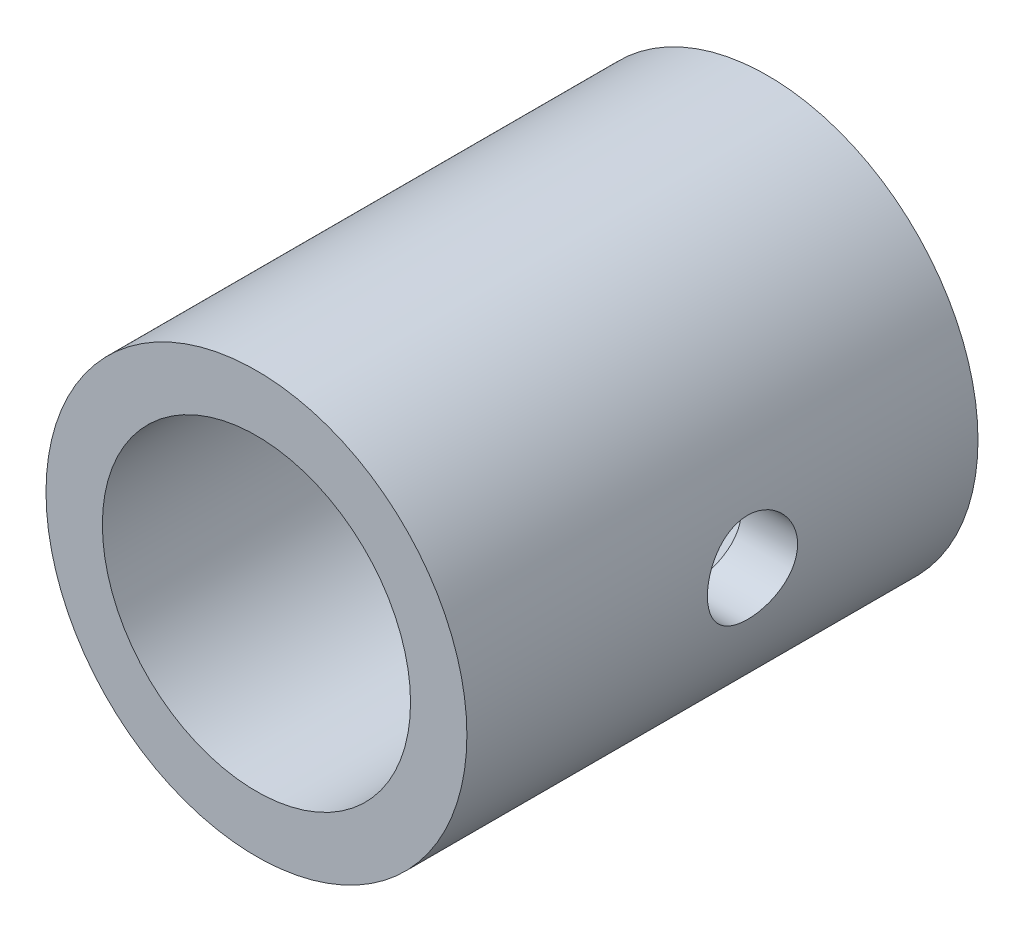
ISO-10303-21;
HEADER;
FILE_DESCRIPTION(('STEP AP214'),'2;1');
FILE_NAME('part.step','',(''),(''),'','','');
FILE_SCHEMA(('AUTOMOTIVE_DESIGN { 1 0 10303 214 1 1 1 1 }'));
ENDSEC;
DATA;
#1=APPLICATION_CONTEXT('core data for automotive mechanical design processes');
#2=APPLICATION_PROTOCOL_DEFINITION('international standard','automotive_design',2000,#1);
#3=PRODUCT_CONTEXT('',#1,'mechanical');
#4=PRODUCT('Part','Part','',(#3));
#5=PRODUCT_RELATED_PRODUCT_CATEGORY('part','',(#4));
#6=PRODUCT_DEFINITION_FORMATION('','',#4);
#7=PRODUCT_DEFINITION_CONTEXT('part definition',#1,'design');
#8=PRODUCT_DEFINITION('design','',#6,#7);
#9=PRODUCT_DEFINITION_SHAPE('','',#8);
#10=(LENGTH_UNIT() NAMED_UNIT(*) SI_UNIT(.MILLI.,.METRE.));
#11=(NAMED_UNIT(*) PLANE_ANGLE_UNIT() SI_UNIT($,.RADIAN.));
#12=(NAMED_UNIT(*) SI_UNIT($,.STERADIAN.) SOLID_ANGLE_UNIT());
#13=UNCERTAINTY_MEASURE_WITH_UNIT(LENGTH_MEASURE(1.E-05),#10,'distance_accuracy_value','');
#14=(GEOMETRIC_REPRESENTATION_CONTEXT(3) GLOBAL_UNCERTAINTY_ASSIGNED_CONTEXT((#13)) GLOBAL_UNIT_ASSIGNED_CONTEXT((#10,
#11,#12)) REPRESENTATION_CONTEXT('',''));
#15=CARTESIAN_POINT('',(0.,0.,0.));
#16=DIRECTION('',(0.,0.,1.));
#17=DIRECTION('',(1.,0.,0.));
#18=AXIS2_PLACEMENT_3D('',#15,#16,#17);
#19=CARTESIAN_POINT('',(0.,0.,34.));
#20=DIRECTION('',(0.,0.,1.));
#21=DIRECTION('',(1.,0.,0.));
#22=AXIS2_PLACEMENT_3D('',#19,#20,#21);
#23=PLANE('',#22);
#24=CARTESIAN_POINT('',(0.,0.,34.));
#25=DIRECTION('',(0.,0.,1.));
#26=DIRECTION('',(1.,0.,0.));
#27=AXIS2_PLACEMENT_3D('',#24,#25,#26);
#28=CIRCLE('',#27,14.);
#29=CARTESIAN_POINT('',(14.,0.,34.));
#30=VERTEX_POINT('',#29);
#31=EDGE_CURVE('E10',#30,#30,#28,.T.);
#32=ORIENTED_EDGE('',*,*,#31,.T.);
#33=EDGE_LOOP('',(#32));
#34=FACE_BOUND('',#33,.T.);
#35=CARTESIAN_POINT('',(0.,0.,34.));
#36=DIRECTION('',(0.,0.,1.));
#37=DIRECTION('',(1.,0.,0.));
#38=AXIS2_PLACEMENT_3D('',#35,#36,#37);
#39=CIRCLE('',#38,10.25);
#40=CARTESIAN_POINT('',(10.25,0.,34.));
#41=VERTEX_POINT('',#40);
#42=EDGE_CURVE('E49',#41,#41,#39,.T.);
#43=ORIENTED_EDGE('',*,*,#42,.F.);
#44=EDGE_LOOP('',(#43));
#45=FACE_BOUND('',#44,.T.);
#46=ADVANCED_FACE('F31',(#34,#45),#23,.T.);
#47=CARTESIAN_POINT('',(0.,0.,0.));
#48=DIRECTION('',(0.,0.,1.));
#49=DIRECTION('',(1.,0.,0.));
#50=AXIS2_PLACEMENT_3D('',#47,#48,#49);
#51=PLANE('',#50);
#52=CARTESIAN_POINT('',(0.,0.,0.));
#53=DIRECTION('',(0.,0.,1.));
#54=DIRECTION('',(1.,0.,0.));
#55=AXIS2_PLACEMENT_3D('',#52,#53,#54);
#56=CIRCLE('',#55,14.);
#57=CARTESIAN_POINT('',(14.,0.,0.));
#58=VERTEX_POINT('',#57);
#59=EDGE_CURVE('E44',#58,#58,#56,.T.);
#60=ORIENTED_EDGE('',*,*,#59,.F.);
#61=EDGE_LOOP('',(#60));
#62=FACE_BOUND('',#61,.T.);
#63=CARTESIAN_POINT('',(0.,0.,0.));
#64=DIRECTION('',(0.,0.,1.));
#65=DIRECTION('',(1.,0.,0.));
#66=AXIS2_PLACEMENT_3D('',#63,#64,#65);
#67=CIRCLE('',#66,10.25);
#68=CARTESIAN_POINT('',(10.25,0.,0.));
#69=VERTEX_POINT('',#68);
#70=EDGE_CURVE('E78',#69,#69,#67,.T.);
#71=ORIENTED_EDGE('',*,*,#70,.T.);
#72=EDGE_LOOP('',(#71));
#73=FACE_BOUND('',#72,.T.);
#74=ADVANCED_FACE('F86',(#62,#73),#51,.F.);
#75=CARTESIAN_POINT('',(0.,0.,34.));
#76=DIRECTION('',(0.,0.,-1.));
#77=DIRECTION('',(-1.,0.,0.));
#78=AXIS2_PLACEMENT_3D('',#75,#76,#77);
#79=CYLINDRICAL_SURFACE('',#78,14.);
#80=CARTESIAN_POINT('',(-14.,0.,12.));
#81=CARTESIAN_POINT('',(-13.9999969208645,0.166471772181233,12.0000057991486));
#82=CARTESIAN_POINT('',(-13.9970005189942,0.333014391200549,12.0139032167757));
#83=CARTESIAN_POINT('',(-13.9853365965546,0.661374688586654,12.0690713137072));
#84=CARTESIAN_POINT('',(-13.976664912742,0.82318880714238,12.1103620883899));
#85=CARTESIAN_POINT('',(-13.9546166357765,1.13729864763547,12.2189687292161));
#86=CARTESIAN_POINT('',(-13.9412448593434,1.28960392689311,12.2862579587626));
#87=CARTESIAN_POINT('',(-13.9112421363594,1.58075635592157,12.4448681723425));
#88=CARTESIAN_POINT('',(-13.8946113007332,1.71960396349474,12.5361883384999));
#89=CARTESIAN_POINT('',(-13.8596273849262,1.98204958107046,12.741760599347));
#90=CARTESIAN_POINT('',(-13.8412536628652,2.1054100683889,12.8563124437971));
#91=CARTESIAN_POINT('',(-13.8050013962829,2.3313208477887,13.1044526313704));
#92=CARTESIAN_POINT('',(-13.7871228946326,2.43386934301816,13.2380426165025));
#93=CARTESIAN_POINT('',(-13.7536823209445,2.61628408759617,13.5222115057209));
#94=CARTESIAN_POINT('',(-13.7381467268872,2.69589916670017,13.6729550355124));
#95=CARTESIAN_POINT('',(-13.7114465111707,2.82857647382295,13.9860689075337));
#96=CARTESIAN_POINT('',(-13.7002813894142,2.88164174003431,14.1484379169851));
#97=CARTESIAN_POINT('',(-13.6837961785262,2.95893148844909,14.4776221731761));
#98=CARTESIAN_POINT('',(-13.6783911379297,2.98357559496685,14.6443345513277));
#99=CARTESIAN_POINT('',(-13.6737827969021,3.00462790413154,14.979608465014));
#100=CARTESIAN_POINT('',(-13.6745787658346,3.00103943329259,15.1481697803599));
#101=CARTESIAN_POINT('',(-13.6822055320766,2.96606652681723,15.4792493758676));
#102=CARTESIAN_POINT('',(-13.6889308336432,2.93516797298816,15.6418217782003));
#103=CARTESIAN_POINT('',(-13.7074918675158,2.84722108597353,15.9594204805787));
#104=CARTESIAN_POINT('',(-13.719327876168,2.79017133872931,16.1144463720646));
#105=CARTESIAN_POINT('',(-13.7468816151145,2.65109102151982,16.4139257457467));
#106=CARTESIAN_POINT('',(-13.7626284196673,2.56887221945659,16.5582890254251));
#107=CARTESIAN_POINT('',(-13.7962114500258,2.38192014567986,16.8313503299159));
#108=CARTESIAN_POINT('',(-13.8140479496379,2.27718392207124,16.9600462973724));
#109=CARTESIAN_POINT('',(-13.8502543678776,2.0455908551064,17.2009187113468));
#110=CARTESIAN_POINT('',(-13.8686276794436,1.91832046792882,17.3126974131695));
#111=CARTESIAN_POINT('',(-13.9035003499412,1.64663461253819,17.5133874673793));
#112=CARTESIAN_POINT('',(-13.9199996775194,1.5022188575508,17.6022984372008));
#113=CARTESIAN_POINT('',(-13.9493155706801,1.19986692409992,17.7548213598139));
#114=CARTESIAN_POINT('',(-13.9621247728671,1.04190451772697,17.818382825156));
#115=CARTESIAN_POINT('',(-13.9825621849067,0.717206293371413,17.9179512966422));
#116=CARTESIAN_POINT('',(-13.9901911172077,0.550471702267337,17.9539621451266));
#117=CARTESIAN_POINT('',(-13.9993061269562,0.216375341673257,17.9968324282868));
#118=CARTESIAN_POINT('',(-14.0009067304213,0.0490863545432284,18.0042354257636));
#119=CARTESIAN_POINT('',(-13.9981049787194,-0.28433794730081,17.9911508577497));
#120=CARTESIAN_POINT('',(-13.993703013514,-0.450473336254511,17.9706651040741));
#121=CARTESIAN_POINT('',(-13.9794628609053,-0.775085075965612,17.9028355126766));
#122=CARTESIAN_POINT('',(-13.9696821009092,-0.933623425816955,17.8557752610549));
#123=CARTESIAN_POINT('',(-13.9457784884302,-1.24055690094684,17.7364461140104));
#124=CARTESIAN_POINT('',(-13.9316552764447,-1.38895118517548,17.6641751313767));
#125=CARTESIAN_POINT('',(-13.900350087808,-1.67364279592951,17.4953329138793));
#126=CARTESIAN_POINT('',(-13.8831286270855,-1.80974515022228,17.3984404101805));
#127=CARTESIAN_POINT('',(-13.8476206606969,-2.06395385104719,17.1835303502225));
#128=CARTESIAN_POINT('',(-13.8293340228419,-2.18205795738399,17.0655101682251));
#129=CARTESIAN_POINT('',(-13.7933634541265,-2.39905422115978,16.8092052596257));
#130=CARTESIAN_POINT('',(-13.7756958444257,-2.49757074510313,16.6705998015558));
#131=CARTESIAN_POINT('',(-13.7433330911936,-2.66992830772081,16.378490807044));
#132=CARTESIAN_POINT('',(-13.7286378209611,-2.74377039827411,16.224987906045));
#133=CARTESIAN_POINT('',(-13.7040201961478,-2.86419482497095,15.9082554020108));
#134=CARTESIAN_POINT('',(-13.6940714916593,-2.9109279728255,15.7450852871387));
#135=CARTESIAN_POINT('',(-13.6800237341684,-2.9762539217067,15.4129688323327));
#136=CARTESIAN_POINT('',(-13.6759237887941,-2.99485101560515,15.2440233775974));
#137=CARTESIAN_POINT('',(-13.6740923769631,-3.00319999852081,14.9089353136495));
#138=CARTESIAN_POINT('',(-13.6762295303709,-2.99354694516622,14.7428079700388));
#139=CARTESIAN_POINT('',(-13.6863352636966,-2.94699578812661,14.4146055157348));
#140=CARTESIAN_POINT('',(-13.6943037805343,-2.91009797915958,14.2525303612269));
#141=CARTESIAN_POINT('',(-13.7151116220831,-2.81038691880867,13.9374826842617));
#142=CARTESIAN_POINT('',(-13.7279352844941,-2.74765694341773,13.7844827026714));
#143=CARTESIAN_POINT('',(-13.757015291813,-2.59813503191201,13.4910892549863));
#144=CARTESIAN_POINT('',(-13.7732719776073,-2.51134070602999,13.3506970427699));
#145=CARTESIAN_POINT('',(-13.8077811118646,-2.31416580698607,13.0835636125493));
#146=CARTESIAN_POINT('',(-13.8260661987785,-2.20335974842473,12.957140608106));
#147=CARTESIAN_POINT('',(-13.8623489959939,-1.96217310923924,12.7244874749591));
#148=CARTESIAN_POINT('',(-13.8803466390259,-1.83178801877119,12.6182620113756));
#149=CARTESIAN_POINT('',(-13.9142898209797,-1.55320629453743,12.4277680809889));
#150=CARTESIAN_POINT('',(-13.9302072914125,-1.40480969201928,12.343786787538));
#151=CARTESIAN_POINT('',(-13.9579165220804,-1.09570032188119,12.2020909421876));
#152=CARTESIAN_POINT('',(-13.9697118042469,-0.934998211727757,12.1443539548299));
#153=CARTESIAN_POINT('',(-13.9856969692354,-0.645070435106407,12.0672956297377));
#154=CARTESIAN_POINT('',(-13.9910278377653,-0.517434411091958,12.0421071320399));
#155=CARTESIAN_POINT('',(-13.9981804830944,-0.259879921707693,12.0084573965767));
#156=CARTESIAN_POINT('',(-14.0000024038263,-0.12996155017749,11.9999954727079));
#157=CARTESIAN_POINT('',(-14.,0.,12.));
#158=B_SPLINE_CURVE_WITH_KNOTS('',3,(#80,#81,#82,#83,#84,#85,#86,#87,#88,#89,#90,#91,#92,#93,
#94,#95,#96,#97,#98,#99,#100,#101,#102,#103,#104,#105,#106,#107,#108,#109,#110,#111,#112,#113,
#114,#115,#116,#117,#118,#119,#120,#121,#122,#123,#124,#125,#126,#127,#128,#129,#130,#131,#132,
#133,#134,#135,#136,#137,#138,#139,#140,#141,#142,#143,#144,#145,#146,#147,#148,#149,#150,#151,
#152,#153,#154,#155,#156,#157),.UNSPECIFIED.,.T.,.F.,(4,2,2,2,2,2,2,2,2,2,2,2,2,2,2,2,2,2,2,2,2,
2,2,2,2,2,2,2,2,2,2,2,2,2,2,2,2,2,4),(0.,0.498939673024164,0.998245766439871,1.4970416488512,
1.99582055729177,2.50149923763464,3.00722155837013,3.5182885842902,4.02929711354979,
4.53266016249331,5.0359639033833,5.53048950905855,6.02504185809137,6.52338712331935,
7.02179775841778,7.53054022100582,8.039291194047,8.54905042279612,9.05873854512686,
9.55869331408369,10.0586156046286,10.5533012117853,11.0480277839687,11.5495746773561,
12.0511839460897,12.5616412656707,13.0720768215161,13.5796448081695,14.0871353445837,
14.5840136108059,15.0808865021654,15.5761699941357,16.0715026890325,16.5764590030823,
17.0815318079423,17.5928382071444,18.1037066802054,18.4932359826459,18.8827493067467),.UNSPECIFIED.);
#159=CARTESIAN_POINT('',(-14.,0.,12.));
#160=VERTEX_POINT('',#159);
#161=EDGE_CURVE('E73',#160,#160,#158,.T.);
#162=ORIENTED_EDGE('',*,*,#161,.T.);
#163=EDGE_LOOP('',(#162));
#164=FACE_BOUND('',#163,.T.);
#165=CARTESIAN_POINT('',(14.,0.,12.));
#166=CARTESIAN_POINT('',(13.9999969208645,-0.166471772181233,12.0000057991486));
#167=CARTESIAN_POINT('',(13.9970005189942,-0.333014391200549,12.0139032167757));
#168=CARTESIAN_POINT('',(13.9853365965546,-0.661374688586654,12.0690713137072));
#169=CARTESIAN_POINT('',(13.976664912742,-0.82318880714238,12.1103620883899));
#170=CARTESIAN_POINT('',(13.9546166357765,-1.13729864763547,12.2189687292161));
#171=CARTESIAN_POINT('',(13.9412448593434,-1.28960392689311,12.2862579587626));
#172=CARTESIAN_POINT('',(13.9112421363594,-1.58075635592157,12.4448681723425));
#173=CARTESIAN_POINT('',(13.8946113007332,-1.71960396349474,12.5361883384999));
#174=CARTESIAN_POINT('',(13.8596273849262,-1.98204958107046,12.741760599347));
#175=CARTESIAN_POINT('',(13.8412536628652,-2.1054100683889,12.8563124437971));
#176=CARTESIAN_POINT('',(13.8050013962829,-2.3313208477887,13.1044526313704));
#177=CARTESIAN_POINT('',(13.7871228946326,-2.43386934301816,13.2380426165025));
#178=CARTESIAN_POINT('',(13.7536823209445,-2.61628408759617,13.5222115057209));
#179=CARTESIAN_POINT('',(13.7381467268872,-2.69589916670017,13.6729550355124));
#180=CARTESIAN_POINT('',(13.7114465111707,-2.82857647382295,13.9860689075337));
#181=CARTESIAN_POINT('',(13.7002813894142,-2.88164174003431,14.1484379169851));
#182=CARTESIAN_POINT('',(13.6837961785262,-2.95893148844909,14.4776221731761));
#183=CARTESIAN_POINT('',(13.6783911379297,-2.98357559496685,14.6443345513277));
#184=CARTESIAN_POINT('',(13.6737827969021,-3.00462790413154,14.979608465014));
#185=CARTESIAN_POINT('',(13.6745787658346,-3.00103943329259,15.1481697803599));
#186=CARTESIAN_POINT('',(13.6822055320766,-2.96606652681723,15.4792493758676));
#187=CARTESIAN_POINT('',(13.6889308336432,-2.93516797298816,15.6418217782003));
#188=CARTESIAN_POINT('',(13.7074918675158,-2.84722108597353,15.9594204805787));
#189=CARTESIAN_POINT('',(13.719327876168,-2.79017133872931,16.1144463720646));
#190=CARTESIAN_POINT('',(13.7468816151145,-2.65109102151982,16.4139257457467));
#191=CARTESIAN_POINT('',(13.7626284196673,-2.56887221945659,16.5582890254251));
#192=CARTESIAN_POINT('',(13.7962114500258,-2.38192014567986,16.8313503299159));
#193=CARTESIAN_POINT('',(13.8140479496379,-2.27718392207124,16.9600462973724));
#194=CARTESIAN_POINT('',(13.8502543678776,-2.0455908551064,17.2009187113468));
#195=CARTESIAN_POINT('',(13.8686276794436,-1.91832046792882,17.3126974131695));
#196=CARTESIAN_POINT('',(13.9035003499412,-1.64663461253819,17.5133874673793));
#197=CARTESIAN_POINT('',(13.9199996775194,-1.5022188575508,17.6022984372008));
#198=CARTESIAN_POINT('',(13.9493155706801,-1.19986692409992,17.7548213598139));
#199=CARTESIAN_POINT('',(13.9621247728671,-1.04190451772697,17.818382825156));
#200=CARTESIAN_POINT('',(13.9825621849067,-0.717206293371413,17.9179512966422));
#201=CARTESIAN_POINT('',(13.9901911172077,-0.550471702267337,17.9539621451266));
#202=CARTESIAN_POINT('',(13.9993061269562,-0.216375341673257,17.9968324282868));
#203=CARTESIAN_POINT('',(14.0009067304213,-0.0490863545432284,18.0042354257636));
#204=CARTESIAN_POINT('',(13.9981049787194,0.28433794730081,17.9911508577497));
#205=CARTESIAN_POINT('',(13.993703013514,0.450473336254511,17.9706651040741));
#206=CARTESIAN_POINT('',(13.9794628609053,0.775085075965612,17.9028355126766));
#207=CARTESIAN_POINT('',(13.9696821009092,0.933623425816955,17.8557752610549));
#208=CARTESIAN_POINT('',(13.9457784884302,1.24055690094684,17.7364461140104));
#209=CARTESIAN_POINT('',(13.9316552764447,1.38895118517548,17.6641751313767));
#210=CARTESIAN_POINT('',(13.900350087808,1.67364279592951,17.4953329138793));
#211=CARTESIAN_POINT('',(13.8831286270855,1.80974515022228,17.3984404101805));
#212=CARTESIAN_POINT('',(13.8476206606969,2.06395385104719,17.1835303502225));
#213=CARTESIAN_POINT('',(13.8293340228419,2.18205795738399,17.0655101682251));
#214=CARTESIAN_POINT('',(13.7933634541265,2.39905422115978,16.8092052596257));
#215=CARTESIAN_POINT('',(13.7756958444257,2.49757074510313,16.6705998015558));
#216=CARTESIAN_POINT('',(13.7433330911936,2.66992830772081,16.378490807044));
#217=CARTESIAN_POINT('',(13.7286378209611,2.74377039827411,16.224987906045));
#218=CARTESIAN_POINT('',(13.7040201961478,2.86419482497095,15.9082554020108));
#219=CARTESIAN_POINT('',(13.6940714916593,2.9109279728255,15.7450852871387));
#220=CARTESIAN_POINT('',(13.6800237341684,2.9762539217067,15.4129688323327));
#221=CARTESIAN_POINT('',(13.6759237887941,2.99485101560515,15.2440233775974));
#222=CARTESIAN_POINT('',(13.6740923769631,3.00319999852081,14.9089353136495));
#223=CARTESIAN_POINT('',(13.6762295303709,2.99354694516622,14.7428079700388));
#224=CARTESIAN_POINT('',(13.6863352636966,2.94699578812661,14.4146055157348));
#225=CARTESIAN_POINT('',(13.6943037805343,2.91009797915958,14.2525303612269));
#226=CARTESIAN_POINT('',(13.7151116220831,2.81038691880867,13.9374826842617));
#227=CARTESIAN_POINT('',(13.7279352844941,2.74765694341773,13.7844827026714));
#228=CARTESIAN_POINT('',(13.757015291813,2.59813503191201,13.4910892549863));
#229=CARTESIAN_POINT('',(13.7732719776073,2.51134070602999,13.3506970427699));
#230=CARTESIAN_POINT('',(13.8077811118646,2.31416580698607,13.0835636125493));
#231=CARTESIAN_POINT('',(13.8260661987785,2.20335974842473,12.957140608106));
#232=CARTESIAN_POINT('',(13.8623489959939,1.96217310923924,12.7244874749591));
#233=CARTESIAN_POINT('',(13.8803466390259,1.83178801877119,12.6182620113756));
#234=CARTESIAN_POINT('',(13.9142898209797,1.55320629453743,12.4277680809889));
#235=CARTESIAN_POINT('',(13.9302072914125,1.40480969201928,12.343786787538));
#236=CARTESIAN_POINT('',(13.9579165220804,1.09570032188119,12.2020909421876));
#237=CARTESIAN_POINT('',(13.9697118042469,0.934998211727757,12.1443539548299));
#238=CARTESIAN_POINT('',(13.9856969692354,0.645070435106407,12.0672956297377));
#239=CARTESIAN_POINT('',(13.9910278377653,0.517434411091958,12.0421071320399));
#240=CARTESIAN_POINT('',(13.9981804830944,0.259879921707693,12.0084573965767));
#241=CARTESIAN_POINT('',(14.0000024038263,0.12996155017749,11.9999954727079));
#242=CARTESIAN_POINT('',(14.,0.,12.));
#243=B_SPLINE_CURVE_WITH_KNOTS('',3,(#165,#166,#167,#168,#169,#170,#171,#172,#173,#174,#175,
#176,#177,#178,#179,#180,#181,#182,#183,#184,#185,#186,#187,#188,#189,#190,#191,#192,#193,#194,
#195,#196,#197,#198,#199,#200,#201,#202,#203,#204,#205,#206,#207,#208,#209,#210,#211,#212,#213,
#214,#215,#216,#217,#218,#219,#220,#221,#222,#223,#224,#225,#226,#227,#228,#229,#230,#231,#232,
#233,#234,#235,#236,#237,#238,#239,#240,#241,#242),.UNSPECIFIED.,.T.,.F.,(4,2,2,2,2,2,2,2,2,2,2,
2,2,2,2,2,2,2,2,2,2,2,2,2,2,2,2,2,2,2,2,2,2,2,2,2,2,2,4),(0.,0.498939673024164,
0.998245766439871,1.4970416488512,1.99582055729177,2.50149923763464,3.00722155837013,
3.5182885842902,4.02929711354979,4.53266016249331,5.0359639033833,5.53048950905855,
6.02504185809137,6.52338712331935,7.02179775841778,7.53054022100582,8.039291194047,
8.54905042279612,9.05873854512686,9.55869331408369,10.0586156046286,10.5533012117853,
11.0480277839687,11.5495746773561,12.0511839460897,12.5616412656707,13.0720768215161,
13.5796448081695,14.0871353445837,14.5840136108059,15.0808865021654,15.5761699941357,
16.0715026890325,16.5764590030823,17.0815318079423,17.5928382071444,18.1037066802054,
18.4932359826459,18.8827493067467),.UNSPECIFIED.);
#244=CARTESIAN_POINT('',(14.,0.,12.));
#245=VERTEX_POINT('',#244);
#246=EDGE_CURVE('E69',#245,#245,#243,.T.);
#247=ORIENTED_EDGE('',*,*,#246,.T.);
#248=EDGE_LOOP('',(#247));
#249=FACE_BOUND('',#248,.T.);
#250=ORIENTED_EDGE('',*,*,#31,.F.);
#251=EDGE_LOOP('',(#250));
#252=FACE_BOUND('',#251,.T.);
#253=ORIENTED_EDGE('',*,*,#59,.T.);
#254=EDGE_LOOP('',(#253));
#255=FACE_BOUND('',#254,.T.);
#256=ADVANCED_FACE('F33',(#164,#249,#252,#255),#79,.T.);
#257=CARTESIAN_POINT('',(0.,0.,34.));
#258=DIRECTION('',(0.,0.,-1.));
#259=DIRECTION('',(-1.,0.,0.));
#260=AXIS2_PLACEMENT_3D('',#257,#258,#259);
#261=CYLINDRICAL_SURFACE('',#260,10.25);
#262=CARTESIAN_POINT('',(-10.25,0.,18.));
#263=CARTESIAN_POINT('',(-10.2499982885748,-0.164761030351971,17.9999975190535));
#264=CARTESIAN_POINT('',(-10.2459891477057,-0.329547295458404,17.9863817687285));
#265=CARTESIAN_POINT('',(-10.230386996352,-0.654332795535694,17.9324001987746));
#266=CARTESIAN_POINT('',(-10.2187914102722,-0.814330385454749,17.8920252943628));
#267=CARTESIAN_POINT('',(-10.1892890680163,-1.12480632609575,17.7859804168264));
#268=CARTESIAN_POINT('',(-10.1713913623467,-1.27529796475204,17.7203467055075));
#269=CARTESIAN_POINT('',(-10.1311520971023,-1.56313982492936,17.5657928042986));
#270=CARTESIAN_POINT('',(-10.1088100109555,-1.70048848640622,17.4768698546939));
#271=CARTESIAN_POINT('',(-10.0613857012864,-1.96191733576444,17.2756873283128));
#272=CARTESIAN_POINT('',(-10.0362493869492,-2.08558550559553,17.1629051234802));
#273=CARTESIAN_POINT('',(-9.98639778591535,-2.31255048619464,16.9183201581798));
#274=CARTESIAN_POINT('',(-9.96168256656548,-2.41584406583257,16.7865143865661));
#275=CARTESIAN_POINT('',(-9.91490371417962,-2.60125899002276,16.5041829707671));
#276=CARTESIAN_POINT('',(-9.89290754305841,-2.68288409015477,16.3533192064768));
#277=CARTESIAN_POINT('',(-9.85486275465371,-2.81943980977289,16.039259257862));
#278=CARTESIAN_POINT('',(-9.83881278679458,-2.87437649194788,15.8760658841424));
#279=CARTESIAN_POINT('',(-9.81504013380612,-2.95452269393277,15.5465920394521));
#280=CARTESIAN_POINT('',(-9.80710592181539,-2.98048902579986,15.380511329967));
#281=CARTESIAN_POINT('',(-9.79983320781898,-3.00431990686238,15.0461759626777));
#282=CARTESIAN_POINT('',(-9.80049273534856,-3.00219089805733,14.8779218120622));
#283=CARTESIAN_POINT('',(-9.81014508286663,-2.97048742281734,14.5501118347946));
#284=CARTESIAN_POINT('',(-9.81885231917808,-2.94185346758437,14.3904552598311));
#285=CARTESIAN_POINT('',(-9.8431580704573,-2.85946944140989,14.0783189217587));
#286=CARTESIAN_POINT('',(-9.85875723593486,-2.80571699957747,13.9258398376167));
#287=CARTESIAN_POINT('',(-9.89532234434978,-2.67391255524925,13.630052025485));
#288=CARTESIAN_POINT('',(-9.91635624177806,-2.59554994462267,13.4868904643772));
#289=CARTESIAN_POINT('',(-9.9613872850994,-2.41696561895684,13.2154303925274));
#290=CARTESIAN_POINT('',(-9.98538511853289,-2.31673882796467,13.0871353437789));
#291=CARTESIAN_POINT('',(-10.0348053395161,-2.09256856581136,12.8437063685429));
#292=CARTESIAN_POINT('',(-10.0602464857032,-1.96784238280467,12.7292958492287));
#293=CARTESIAN_POINT('',(-10.1088414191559,-1.70065773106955,12.5228512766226));
#294=CARTESIAN_POINT('',(-10.1319950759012,-1.55819825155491,12.4308184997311));
#295=CARTESIAN_POINT('',(-10.1736007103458,-1.25832091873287,12.271330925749));
#296=CARTESIAN_POINT('',(-10.1920230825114,-1.10081695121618,12.2040298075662));
#297=CARTESIAN_POINT('',(-10.2218771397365,-0.77606283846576,12.097082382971));
#298=CARTESIAN_POINT('',(-10.2333106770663,-0.60881528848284,12.0574287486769));
#299=CARTESIAN_POINT('',(-10.2476087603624,-0.275476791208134,12.0080905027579));
#300=CARTESIAN_POINT('',(-10.2507537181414,-0.109542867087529,11.9974247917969));
#301=CARTESIAN_POINT('',(-10.2489391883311,0.221751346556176,12.003624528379));
#302=CARTESIAN_POINT('',(-10.2439807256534,0.387111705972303,12.020486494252));
#303=CARTESIAN_POINT('',(-10.2266995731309,0.708907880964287,12.0804667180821));
#304=CARTESIAN_POINT('',(-10.2145361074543,0.865458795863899,12.1230176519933));
#305=CARTESIAN_POINT('',(-10.1842453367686,1.16917031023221,12.2324908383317));
#306=CARTESIAN_POINT('',(-10.1661173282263,1.31632979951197,12.2994159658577));
#307=CARTESIAN_POINT('',(-10.1252781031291,1.60073763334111,12.4574236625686));
#308=CARTESIAN_POINT('',(-10.1024733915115,1.7376904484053,12.5490133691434));
#309=CARTESIAN_POINT('',(-10.0549039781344,1.99461950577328,12.7531294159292));
#310=CARTESIAN_POINT('',(-10.0301388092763,2.11459168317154,12.8656607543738));
#311=CARTESIAN_POINT('',(-9.98037315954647,2.33843282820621,13.113070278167));
#312=CARTESIAN_POINT('',(-9.95539395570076,2.44160478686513,13.2485846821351));
#313=CARTESIAN_POINT('',(-9.90894158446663,2.62378498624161,13.5355442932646));
#314=CARTESIAN_POINT('',(-9.88746830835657,2.70279397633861,13.6869890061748));
#315=CARTESIAN_POINT('',(-9.85070881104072,2.83384433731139,14.0009476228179));
#316=CARTESIAN_POINT('',(-9.83539162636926,2.88602104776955,14.1634012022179));
#317=CARTESIAN_POINT('',(-9.81273906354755,2.9621376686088,14.4953159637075));
#318=CARTESIAN_POINT('',(-9.80540111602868,2.98608666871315,14.6647748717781));
#319=CARTESIAN_POINT('',(-9.79978244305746,3.00447077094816,14.9986741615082));
#320=CARTESIAN_POINT('',(-9.80115420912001,3.00003820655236,15.1630471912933));
#321=CARTESIAN_POINT('',(-9.81196987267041,2.96447047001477,15.4885940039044));
#322=CARTESIAN_POINT('',(-9.82141347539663,2.93333627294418,15.6497679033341));
#323=CARTESIAN_POINT('',(-9.84708138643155,2.8459639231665,15.9625882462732));
#324=CARTESIAN_POINT('',(-9.8632282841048,2.79001188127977,16.1143214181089));
#325=CARTESIAN_POINT('',(-9.90047257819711,2.65481394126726,16.4063673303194));
#326=CARTESIAN_POINT('',(-9.92157088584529,2.57556375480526,16.5466779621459));
#327=CARTESIAN_POINT('',(-9.96725898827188,2.39278153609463,16.8171853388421));
#328=CARTESIAN_POINT('',(-9.99194486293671,2.28849929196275,16.9468589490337));
#329=CARTESIAN_POINT('',(-10.0415451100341,2.05998084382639,17.1872335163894));
#330=CARTESIAN_POINT('',(-10.0664595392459,1.93573954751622,17.297929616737));
#331=CARTESIAN_POINT('',(-10.11452652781,1.66673369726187,17.5002165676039));
#332=CARTESIAN_POINT('',(-10.1376122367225,1.52150065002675,17.5912018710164));
#333=CARTESIAN_POINT('',(-10.1786359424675,1.21712309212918,17.7473316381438));
#334=CARTESIAN_POINT('',(-10.1965765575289,1.05798571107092,17.812489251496));
#335=CARTESIAN_POINT('',(-10.2235467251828,0.750037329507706,17.9086533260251));
#336=CARTESIAN_POINT('',(-10.2333870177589,0.602277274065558,17.9428186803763));
#337=CARTESIAN_POINT('',(-10.2466139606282,0.303018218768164,17.9884914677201));
#338=CARTESIAN_POINT('',(-10.2500015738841,0.151519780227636,18.0000022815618));
#339=CARTESIAN_POINT('',(-10.25,0.,18.));
#340=B_SPLINE_CURVE_WITH_KNOTS('',3,(#262,#263,#264,#265,#266,#267,#268,#269,#270,#271,#272,
#273,#274,#275,#276,#277,#278,#279,#280,#281,#282,#283,#284,#285,#286,#287,#288,#289,#290,#291,
#292,#293,#294,#295,#296,#297,#298,#299,#300,#301,#302,#303,#304,#305,#306,#307,#308,#309,#310,
#311,#312,#313,#314,#315,#316,#317,#318,#319,#320,#321,#322,#323,#324,#325,#326,#327,#328,#329,
#330,#331,#332,#333,#334,#335,#336,#337,#338,#339),.UNSPECIFIED.,.T.,.F.,(4,2,2,2,2,2,2,2,2,2,2,
2,2,2,2,2,2,2,2,2,2,2,2,2,2,2,2,2,2,2,2,2,2,2,2,2,2,2,4),(0.,0.493726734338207,
0.987621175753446,1.48080920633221,1.97405570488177,2.47949748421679,2.98501935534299,
3.50127745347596,4.01741822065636,4.51973447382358,5.02193555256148,5.50697252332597,
5.99205528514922,6.48352459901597,6.9751081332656,7.48618028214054,7.99728157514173,
8.51150712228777,9.02559632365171,9.52205577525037,10.0184524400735,10.504268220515,
10.9901413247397,11.4868885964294,11.9837545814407,12.4977349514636,13.011699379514,
13.5230453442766,14.0342266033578,14.5251440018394,15.0160434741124,15.5014250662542,
15.9868960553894,16.4892919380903,16.991816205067,17.5080888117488,18.0240982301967,
18.4782137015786,18.9322613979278),.UNSPECIFIED.);
#341=CARTESIAN_POINT('',(-10.25,0.,18.));
#342=VERTEX_POINT('',#341);
#343=EDGE_CURVE('E36',#342,#342,#340,.T.);
#344=ORIENTED_EDGE('',*,*,#343,.F.);
#345=EDGE_LOOP('',(#344));
#346=FACE_BOUND('',#345,.T.);
#347=CARTESIAN_POINT('',(10.25,0.,12.));
#348=CARTESIAN_POINT('',(10.2499982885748,-0.164761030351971,12.0000024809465));
#349=CARTESIAN_POINT('',(10.2459891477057,-0.329547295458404,12.0136182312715));
#350=CARTESIAN_POINT('',(10.230386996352,-0.654332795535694,12.0675998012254));
#351=CARTESIAN_POINT('',(10.2187914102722,-0.814330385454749,12.1079747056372));
#352=CARTESIAN_POINT('',(10.1892890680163,-1.12480632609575,12.2140195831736));
#353=CARTESIAN_POINT('',(10.1713913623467,-1.27529796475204,12.2796532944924));
#354=CARTESIAN_POINT('',(10.1311520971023,-1.56313982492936,12.4342071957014));
#355=CARTESIAN_POINT('',(10.1088100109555,-1.70048848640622,12.5231301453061));
#356=CARTESIAN_POINT('',(10.0613857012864,-1.96191733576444,12.7243126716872));
#357=CARTESIAN_POINT('',(10.0362493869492,-2.08558550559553,12.8370948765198));
#358=CARTESIAN_POINT('',(9.98639778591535,-2.31255048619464,13.0816798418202));
#359=CARTESIAN_POINT('',(9.96168256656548,-2.41584406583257,13.2134856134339));
#360=CARTESIAN_POINT('',(9.91490371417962,-2.60125899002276,13.4958170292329));
#361=CARTESIAN_POINT('',(9.89290754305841,-2.68288409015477,13.6466807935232));
#362=CARTESIAN_POINT('',(9.85486275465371,-2.81943980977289,13.960740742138));
#363=CARTESIAN_POINT('',(9.83881278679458,-2.87437649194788,14.1239341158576));
#364=CARTESIAN_POINT('',(9.81504013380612,-2.95452269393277,14.4534079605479));
#365=CARTESIAN_POINT('',(9.80710592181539,-2.98048902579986,14.619488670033));
#366=CARTESIAN_POINT('',(9.79983320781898,-3.00431990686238,14.9538240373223));
#367=CARTESIAN_POINT('',(9.80049273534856,-3.00219089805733,15.1220781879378));
#368=CARTESIAN_POINT('',(9.81014508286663,-2.97048742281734,15.4498881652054));
#369=CARTESIAN_POINT('',(9.81885231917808,-2.94185346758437,15.6095447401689));
#370=CARTESIAN_POINT('',(9.8431580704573,-2.85946944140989,15.9216810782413));
#371=CARTESIAN_POINT('',(9.85875723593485,-2.80571699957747,16.0741601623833));
#372=CARTESIAN_POINT('',(9.89532234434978,-2.67391255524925,16.369947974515));
#373=CARTESIAN_POINT('',(9.91635624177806,-2.59554994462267,16.5131095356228));
#374=CARTESIAN_POINT('',(9.9613872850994,-2.41696561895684,16.7845696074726));
#375=CARTESIAN_POINT('',(9.98538511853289,-2.31673882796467,16.9128646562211));
#376=CARTESIAN_POINT('',(10.0348053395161,-2.09256856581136,17.1562936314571));
#377=CARTESIAN_POINT('',(10.0602464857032,-1.96784238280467,17.2707041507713));
#378=CARTESIAN_POINT('',(10.1088414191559,-1.70065773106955,17.4771487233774));
#379=CARTESIAN_POINT('',(10.1319950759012,-1.55819825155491,17.5691815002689));
#380=CARTESIAN_POINT('',(10.1736007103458,-1.25832091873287,17.728669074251));
#381=CARTESIAN_POINT('',(10.1920230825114,-1.10081695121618,17.7959701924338));
#382=CARTESIAN_POINT('',(10.2218771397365,-0.776062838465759,17.902917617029));
#383=CARTESIAN_POINT('',(10.2333106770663,-0.60881528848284,17.9425712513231));
#384=CARTESIAN_POINT('',(10.2476087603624,-0.275476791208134,17.9919094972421));
#385=CARTESIAN_POINT('',(10.2507537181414,-0.109542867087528,18.0025752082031));
#386=CARTESIAN_POINT('',(10.2489391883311,0.221751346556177,17.996375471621));
#387=CARTESIAN_POINT('',(10.2439807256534,0.387111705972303,17.979513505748));
#388=CARTESIAN_POINT('',(10.2266995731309,0.708907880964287,17.9195332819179));
#389=CARTESIAN_POINT('',(10.2145361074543,0.865458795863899,17.8769823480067));
#390=CARTESIAN_POINT('',(10.1842453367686,1.16917031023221,17.7675091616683));
#391=CARTESIAN_POINT('',(10.1661173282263,1.31632979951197,17.7005840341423));
#392=CARTESIAN_POINT('',(10.1252781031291,1.60073763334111,17.5425763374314));
#393=CARTESIAN_POINT('',(10.1024733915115,1.7376904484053,17.4509866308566));
#394=CARTESIAN_POINT('',(10.0549039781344,1.99461950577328,17.2468705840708));
#395=CARTESIAN_POINT('',(10.0301388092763,2.11459168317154,17.1343392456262));
#396=CARTESIAN_POINT('',(9.98037315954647,2.33843282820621,16.886929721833));
#397=CARTESIAN_POINT('',(9.95539395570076,2.44160478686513,16.7514153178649));
#398=CARTESIAN_POINT('',(9.90894158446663,2.62378498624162,16.4644557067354));
#399=CARTESIAN_POINT('',(9.88746830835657,2.70279397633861,16.3130109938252));
#400=CARTESIAN_POINT('',(9.85070881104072,2.83384433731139,15.9990523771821));
#401=CARTESIAN_POINT('',(9.83539162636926,2.88602104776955,15.8365987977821));
#402=CARTESIAN_POINT('',(9.81273906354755,2.9621376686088,15.5046840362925));
#403=CARTESIAN_POINT('',(9.80540111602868,2.98608666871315,15.3352251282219));
#404=CARTESIAN_POINT('',(9.79978244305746,3.00447077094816,15.0013258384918));
#405=CARTESIAN_POINT('',(9.80115420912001,3.00003820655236,14.8369528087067));
#406=CARTESIAN_POINT('',(9.81196987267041,2.96447047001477,14.5114059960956));
#407=CARTESIAN_POINT('',(9.82141347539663,2.93333627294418,14.3502320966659));
#408=CARTESIAN_POINT('',(9.84708138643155,2.8459639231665,14.0374117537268));
#409=CARTESIAN_POINT('',(9.8632282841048,2.79001188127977,13.8856785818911));
#410=CARTESIAN_POINT('',(9.90047257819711,2.65481394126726,13.5936326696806));
#411=CARTESIAN_POINT('',(9.92157088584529,2.57556375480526,13.4533220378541));
#412=CARTESIAN_POINT('',(9.96725898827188,2.39278153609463,13.1828146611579));
#413=CARTESIAN_POINT('',(9.99194486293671,2.28849929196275,13.0531410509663));
#414=CARTESIAN_POINT('',(10.0415451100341,2.05998084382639,12.8127664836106));
#415=CARTESIAN_POINT('',(10.0664595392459,1.93573954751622,12.7020703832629));
#416=CARTESIAN_POINT('',(10.11452652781,1.66673369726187,12.4997834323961));
#417=CARTESIAN_POINT('',(10.1376122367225,1.52150065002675,12.4087981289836));
#418=CARTESIAN_POINT('',(10.1786359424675,1.21712309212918,12.2526683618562));
#419=CARTESIAN_POINT('',(10.1965765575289,1.05798571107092,12.187510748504));
#420=CARTESIAN_POINT('',(10.2235467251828,0.750037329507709,12.0913466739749));
#421=CARTESIAN_POINT('',(10.2333870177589,0.60227727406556,12.0571813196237));
#422=CARTESIAN_POINT('',(10.2466139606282,0.303018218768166,12.0115085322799));
#423=CARTESIAN_POINT('',(10.2500015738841,0.151519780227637,11.9999977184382));
#424=CARTESIAN_POINT('',(10.25,0.,12.));
#425=B_SPLINE_CURVE_WITH_KNOTS('',3,(#347,#348,#349,#350,#351,#352,#353,#354,#355,#356,#357,
#358,#359,#360,#361,#362,#363,#364,#365,#366,#367,#368,#369,#370,#371,#372,#373,#374,#375,#376,
#377,#378,#379,#380,#381,#382,#383,#384,#385,#386,#387,#388,#389,#390,#391,#392,#393,#394,#395,
#396,#397,#398,#399,#400,#401,#402,#403,#404,#405,#406,#407,#408,#409,#410,#411,#412,#413,#414,
#415,#416,#417,#418,#419,#420,#421,#422,#423,#424),.UNSPECIFIED.,.T.,.F.,(4,2,2,2,2,2,2,2,2,2,2,
2,2,2,2,2,2,2,2,2,2,2,2,2,2,2,2,2,2,2,2,2,2,2,2,2,2,2,4),(0.,0.493726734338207,
0.987621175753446,1.48080920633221,1.97405570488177,2.47949748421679,2.98501935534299,
3.50127745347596,4.01741822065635,4.51973447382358,5.02193555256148,5.50697252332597,
5.99205528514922,6.48352459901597,6.9751081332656,7.48618028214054,7.99728157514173,
8.51150712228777,9.02559632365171,9.52205577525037,10.0184524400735,10.504268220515,
10.9901413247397,11.4868885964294,11.9837545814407,12.4977349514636,13.011699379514,
13.5230453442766,14.0342266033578,14.5251440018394,15.0160434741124,15.5014250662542,
15.9868960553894,16.4892919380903,16.991816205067,17.5080888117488,18.0240982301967,
18.4782137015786,18.9322613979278),.UNSPECIFIED.);
#426=CARTESIAN_POINT('',(10.25,0.,12.));
#427=VERTEX_POINT('',#426);
#428=EDGE_CURVE('E52',#427,#427,#425,.T.);
#429=ORIENTED_EDGE('',*,*,#428,.F.);
#430=EDGE_LOOP('',(#429));
#431=FACE_BOUND('',#430,.T.);
#432=ORIENTED_EDGE('',*,*,#42,.T.);
#433=EDGE_LOOP('',(#432));
#434=FACE_BOUND('',#433,.T.);
#435=ORIENTED_EDGE('',*,*,#70,.F.);
#436=EDGE_LOOP('',(#435));
#437=FACE_BOUND('',#436,.T.);
#438=ADVANCED_FACE('F56',(#346,#431,#434,#437),#261,.F.);
#439=CARTESIAN_POINT('',(-14.,0.,15.));
#440=DIRECTION('',(1.,0.,0.));
#441=DIRECTION('',(0.,0.,-1.));
#442=AXIS2_PLACEMENT_3D('',#439,#440,#441);
#443=CYLINDRICAL_SURFACE('',#442,3.);
#444=ORIENTED_EDGE('',*,*,#428,.T.);
#445=EDGE_LOOP('',(#444));
#446=FACE_BOUND('',#445,.T.);
#447=ORIENTED_EDGE('',*,*,#246,.F.);
#448=EDGE_LOOP('',(#447));
#449=FACE_BOUND('',#448,.T.);
#450=ADVANCED_FACE('F62',(#446,#449),#443,.F.);
#451=ORIENTED_EDGE('',*,*,#343,.T.);
#452=EDGE_LOOP('',(#451));
#453=FACE_BOUND('',#452,.T.);
#454=ORIENTED_EDGE('',*,*,#161,.F.);
#455=EDGE_LOOP('',(#454));
#456=FACE_BOUND('',#455,.T.);
#457=ADVANCED_FACE('F59',(#453,#456),#443,.F.);
#458=CLOSED_SHELL('',(#46,#74,#256,#438,#450,#457));
#459=MANIFOLD_SOLID_BREP('B2',#458);
#460=ADVANCED_BREP_SHAPE_REPRESENTATION('',(#18,#459),#14);
#461=SHAPE_DEFINITION_REPRESENTATION(#9,#460);
ENDSEC;
END-ISO-10303-21;
